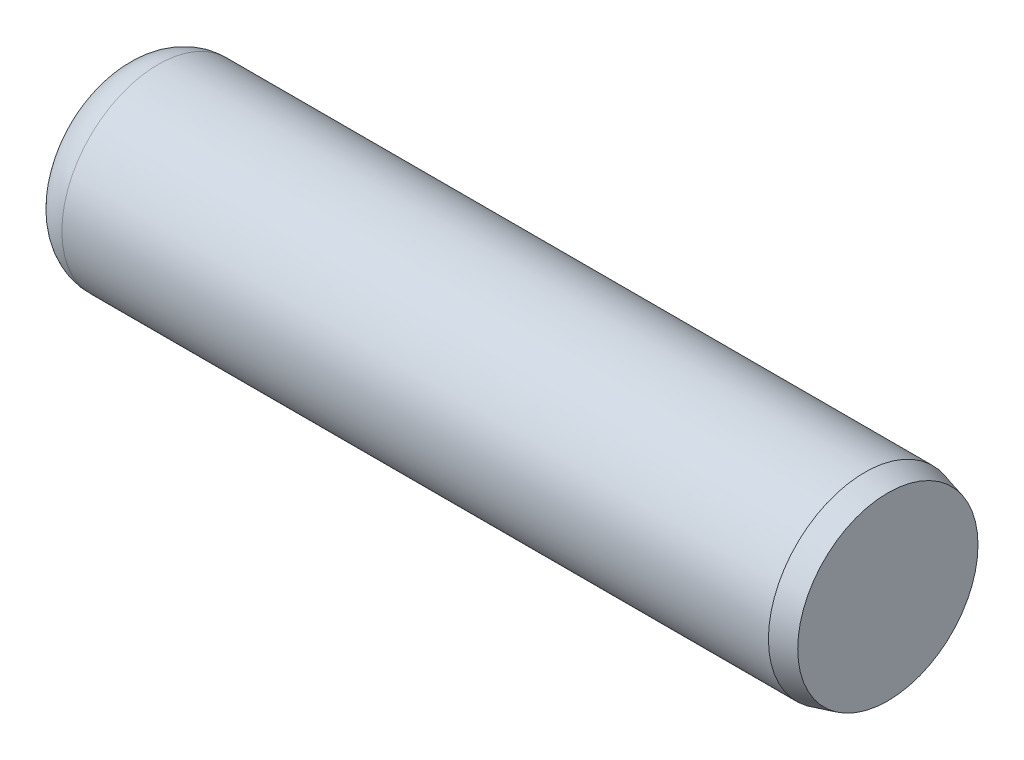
from build123d import *


with BuildPart() as part:
    # Sketch1 → Base-Revolve (revolve)
    with BuildSketch(Plane.XY, mode=Mode.PRIVATE) as base_revolve_sk:
        with BuildLine():
            Line((0, 0), (6.35, 0))
            Line((6.35, 0), (6.35, 0.745082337))
            Line((6.35, 0.745082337), (6.1588904, 0.79629))
            Line((6.1588904, 0.79629), (0.318516, 0.79629))
            ThreePointArc((0.318516, 0.79629), (0.093291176, 0.702998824), (0, 0.477774))
            Line((0, 0.477774), (0, 0))
        make_face()
    revolve(base_revolve_sk.sketch.rotate(Axis((-6.35, 0, 0), (1, 0, 0)), 90), axis=Axis((-6.35, 0, 0), (1, 0, 0)))


solid = part.part
